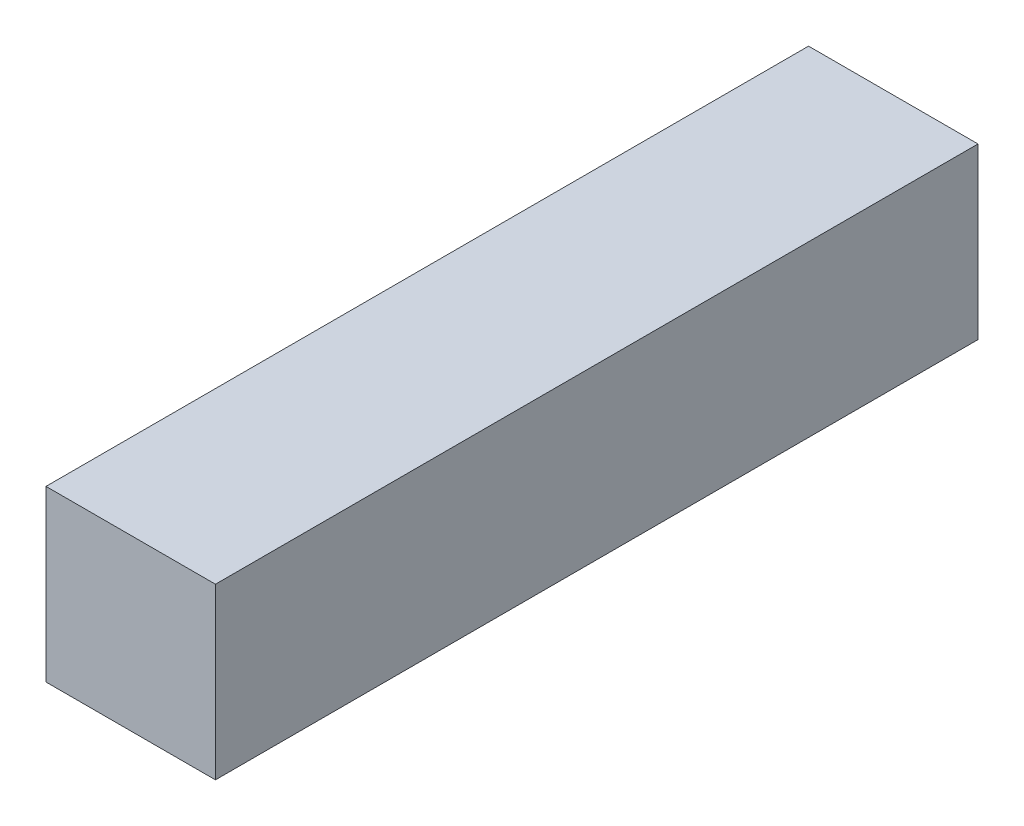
from build123d import *

# Parameters (mm, degrees)
ESQUISSE1_W          = 20
ESQUISSE1_H          = 20
BASE_EXTRUSION_DEPTH = 90


with BuildPart() as part:
    # Esquisse1 → Base-Extrusion (new body)
    with BuildSketch(Plane.XY):
        with Locations((10, 10)):
            Rectangle(ESQUISSE1_W, ESQUISSE1_H)
    extrude(amount=BASE_EXTRUSION_DEPTH)


solid = part.part
